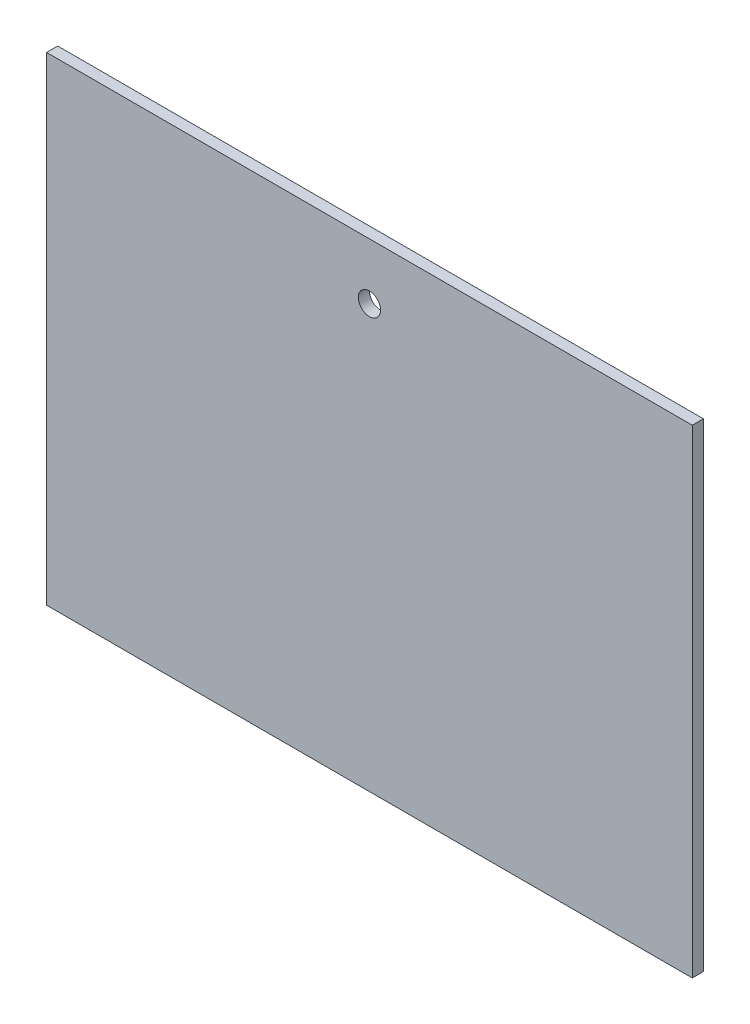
from build123d import *

# Parameters (mm, degrees)
BOSS_EXTRU_1_DEPTH      = 10
ESQUISSE2_R             = 10
ENL_V_MAT_EXTRU_1_DEPTH = 30


with BuildPart() as part:
    # Esquisse1 → Boss.-Extru.1 (new body)
    with BuildSketch(Plane.XY):
        Polygon((510.716073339, 50.527119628), (-69.283926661, 50.527119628), (-69.283926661, -369.472880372), (-69.283926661, -379.472880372), (510.716073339, -379.472880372), (510.716073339, -369.472880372), align=None)
    extrude(amount=BOSS_EXTRU_1_DEPTH)

    # Esquisse2 → Enl_v. mat.-Extru.1 (cut)
    with BuildSketch(Plane.XY.offset(10)):
        with Locations((220.716073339, 0)):
            Circle(ESQUISSE2_R)
    extrude(amount=-ENL_V_MAT_EXTRU_1_DEPTH, mode=Mode.SUBTRACT)


solid = part.part
